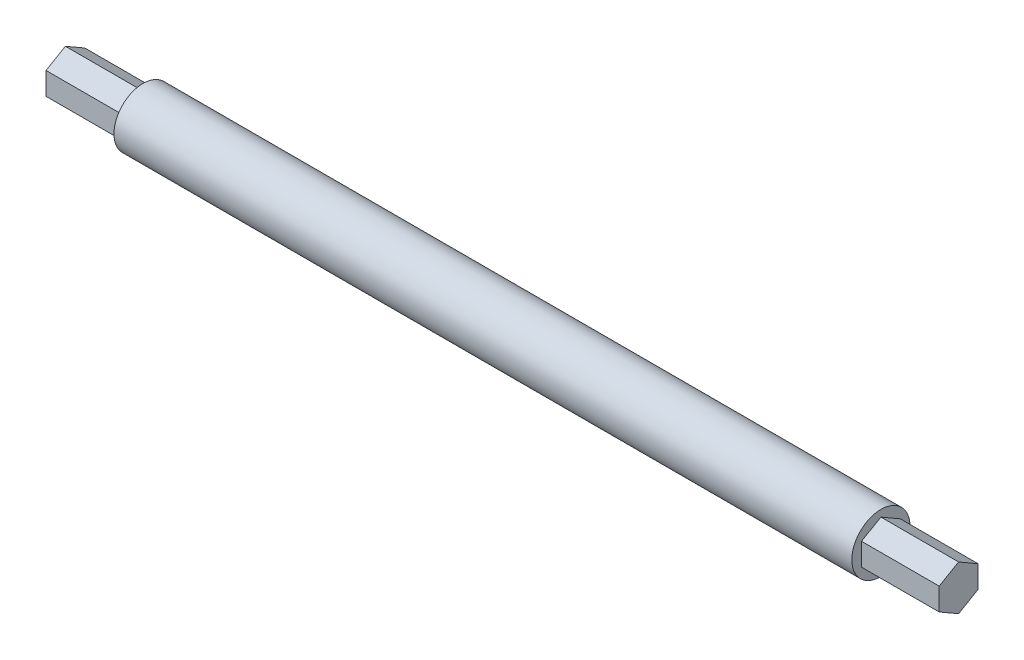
from build123d import *

# Parameters (mm, degrees)
SKETCH_1_W      = 380
SKETCH_1_H      = 15
EXTRUDE_1_DEPTH = 40
EXTRUDE_2_DEPTH = 40


with BuildPart() as part:
    # Sketch 1 → Revolve 1 (revolve)
    with BuildSketch(Plane.XY, mode=Mode.PRIVATE) as revolve_1_sk:
        with Locations((0, 7.5)):
            Rectangle(SKETCH_1_W, SKETCH_1_H)
    revolve(revolve_1_sk.sketch.rotate(Axis((-233.547445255, 0, 0), (1, 0, 0)), 90), axis=Axis((-233.547445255, 0, 0), (1, 0, 0)))

    # Sketch 2 → Extrude 1 (add)
    with BuildSketch(Plane.ZY.offset(190)):
        Polygon((0, 11.547005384), (-10, 5.773502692), (-10, -5.773502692), (0, -11.547005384), (10, -5.773502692), (10, 5.773502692), align=None)
    extrude(amount=EXTRUDE_1_DEPTH)

    # Sketch 3 → Extrude 2 (add)
    with BuildSketch(Plane(origin=(190, 0, 0), x_dir=(0, 0, -1), z_dir=(1, 0, 0))):
        Polygon((10, 5.773502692), (0, 11.547005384), (-10, 5.773502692), (-10, -5.773502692), (0, -11.547005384), (10, -5.773502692), align=None)
    extrude(amount=EXTRUDE_2_DEPTH)


solid = part.part
